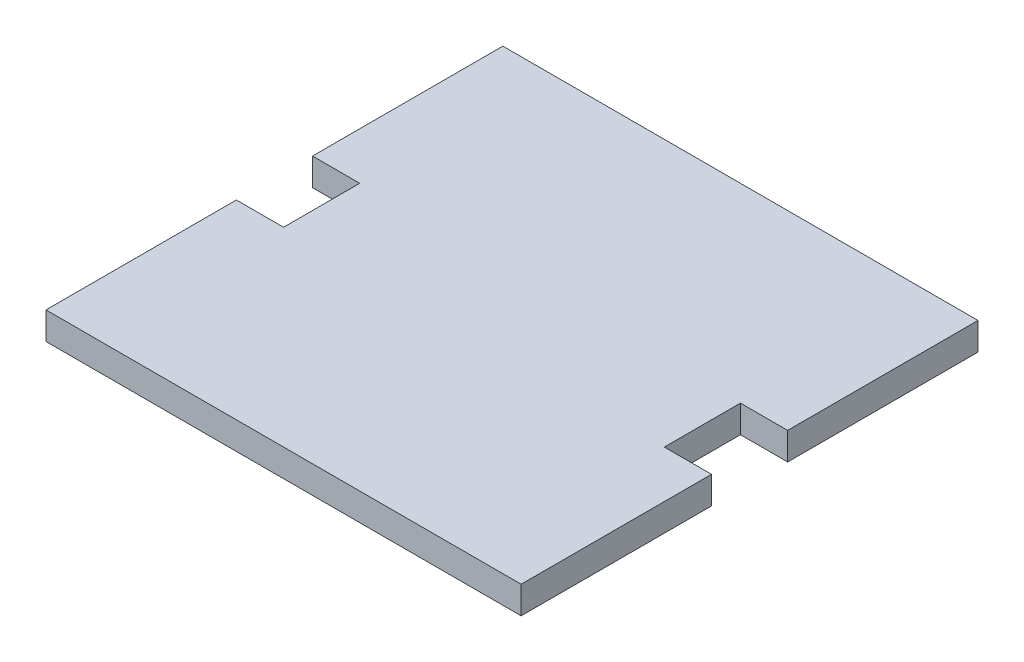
ISO-10303-21;
HEADER;
FILE_DESCRIPTION(('STEP AP214'),'2;1');
FILE_NAME('part.step','',(''),(''),'','','');
FILE_SCHEMA(('AUTOMOTIVE_DESIGN { 1 0 10303 214 1 1 1 1 }'));
ENDSEC;
DATA;
#1=APPLICATION_CONTEXT('core data for automotive mechanical design processes');
#2=APPLICATION_PROTOCOL_DEFINITION('international standard','automotive_design',2000,#1);
#3=PRODUCT_CONTEXT('',#1,'mechanical');
#4=PRODUCT('Part','Part','',(#3));
#5=PRODUCT_RELATED_PRODUCT_CATEGORY('part','',(#4));
#6=PRODUCT_DEFINITION_FORMATION('','',#4);
#7=PRODUCT_DEFINITION_CONTEXT('part definition',#1,'design');
#8=PRODUCT_DEFINITION('design','',#6,#7);
#9=PRODUCT_DEFINITION_SHAPE('','',#8);
#10=(LENGTH_UNIT() NAMED_UNIT(*) SI_UNIT(.MILLI.,.METRE.));
#11=(NAMED_UNIT(*) PLANE_ANGLE_UNIT() SI_UNIT($,.RADIAN.));
#12=(NAMED_UNIT(*) SI_UNIT($,.STERADIAN.) SOLID_ANGLE_UNIT());
#13=UNCERTAINTY_MEASURE_WITH_UNIT(LENGTH_MEASURE(1.E-05),#10,'distance_accuracy_value','');
#14=(GEOMETRIC_REPRESENTATION_CONTEXT(3) GLOBAL_UNCERTAINTY_ASSIGNED_CONTEXT((#13)) GLOBAL_UNIT_ASSIGNED_CONTEXT((#10,
#11,#12)) REPRESENTATION_CONTEXT('',''));
#15=CARTESIAN_POINT('',(0.,0.,0.));
#16=DIRECTION('',(0.,0.,1.));
#17=DIRECTION('',(1.,0.,0.));
#18=AXIS2_PLACEMENT_3D('',#15,#16,#17);
#19=CARTESIAN_POINT('',(-156.,18.,-150.));
#20=DIRECTION('',(1.,0.,0.));
#21=DIRECTION('',(0.,0.,-1.));
#22=AXIS2_PLACEMENT_3D('',#19,#20,#21);
#23=PLANE('',#22);
#24=DIRECTION('',(0.,0.,1.));
#25=VECTOR('',#24,1.);
#26=CARTESIAN_POINT('',(-156.,0.,-150.));
#27=LINE('',#26,#25);
#28=CARTESIAN_POINT('',(-156.,0.,-150.));
#29=VERTEX_POINT('',#28);
#30=CARTESIAN_POINT('',(-156.,0.,-25.));
#31=VERTEX_POINT('',#30);
#32=EDGE_CURVE('E118',#29,#31,#27,.T.);
#33=ORIENTED_EDGE('',*,*,#32,.T.);
#34=DIRECTION('',(0.,-1.,0.));
#35=VECTOR('',#34,1.);
#36=CARTESIAN_POINT('',(-156.,18.,-25.));
#37=LINE('',#36,#35);
#38=CARTESIAN_POINT('',(-156.,18.,-25.));
#39=VERTEX_POINT('',#38);
#40=EDGE_CURVE('E11',#39,#31,#37,.T.);
#41=ORIENTED_EDGE('',*,*,#40,.F.);
#42=DIRECTION('',(0.,0.,1.));
#43=VECTOR('',#42,1.);
#44=CARTESIAN_POINT('',(-156.,18.,-150.));
#45=LINE('',#44,#43);
#46=CARTESIAN_POINT('',(-156.,18.,-150.));
#47=VERTEX_POINT('',#46);
#48=EDGE_CURVE('E153',#47,#39,#45,.T.);
#49=ORIENTED_EDGE('',*,*,#48,.F.);
#50=DIRECTION('',(0.,-1.,0.));
#51=VECTOR('',#50,1.);
#52=CARTESIAN_POINT('',(-156.,18.,-150.));
#53=LINE('',#52,#51);
#54=EDGE_CURVE('E131',#47,#29,#53,.T.);
#55=ORIENTED_EDGE('',*,*,#54,.T.);
#56=EDGE_LOOP('',(#33,#41,#49,#55));
#57=FACE_BOUND('',#56,.T.);
#58=ADVANCED_FACE('F26',(#57),#23,.F.);
#59=CARTESIAN_POINT('',(-156.,18.,-25.));
#60=DIRECTION('',(0.,0.,-1.));
#61=DIRECTION('',(-1.,0.,0.));
#62=AXIS2_PLACEMENT_3D('',#59,#60,#61);
#63=PLANE('',#62);
#64=DIRECTION('',(1.,0.,0.));
#65=VECTOR('',#64,1.);
#66=CARTESIAN_POINT('',(-156.,0.,-25.));
#67=LINE('',#66,#65);
#68=CARTESIAN_POINT('',(-125.,0.,-25.));
#69=VERTEX_POINT('',#68);
#70=EDGE_CURVE('E114',#31,#69,#67,.T.);
#71=ORIENTED_EDGE('',*,*,#70,.T.);
#72=DIRECTION('',(0.,-1.,0.));
#73=VECTOR('',#72,1.);
#74=CARTESIAN_POINT('',(-125.,18.,-25.));
#75=LINE('',#74,#73);
#76=CARTESIAN_POINT('',(-125.,18.,-25.));
#77=VERTEX_POINT('',#76);
#78=EDGE_CURVE('E33',#77,#69,#75,.T.);
#79=ORIENTED_EDGE('',*,*,#78,.F.);
#80=DIRECTION('',(1.,0.,0.));
#81=VECTOR('',#80,1.);
#82=CARTESIAN_POINT('',(-156.,18.,-25.));
#83=LINE('',#82,#81);
#84=EDGE_CURVE('E127',#39,#77,#83,.T.);
#85=ORIENTED_EDGE('',*,*,#84,.F.);
#86=ORIENTED_EDGE('',*,*,#40,.T.);
#87=EDGE_LOOP('',(#71,#79,#85,#86));
#88=FACE_BOUND('',#87,.T.);
#89=ADVANCED_FACE('F126',(#88),#63,.F.);
#90=CARTESIAN_POINT('',(-125.,18.,25.));
#91=DIRECTION('',(1.,0.,0.));
#92=DIRECTION('',(0.,0.,-1.));
#93=AXIS2_PLACEMENT_3D('',#90,#91,#92);
#94=PLANE('',#93);
#95=DIRECTION('',(0.,0.,1.));
#96=VECTOR('',#95,1.);
#97=CARTESIAN_POINT('',(-125.,0.,25.));
#98=LINE('',#97,#96);
#99=CARTESIAN_POINT('',(-125.,0.,25.));
#100=VERTEX_POINT('',#99);
#101=EDGE_CURVE('E120',#69,#100,#98,.T.);
#102=ORIENTED_EDGE('',*,*,#101,.T.);
#103=DIRECTION('',(0.,-1.,0.));
#104=VECTOR('',#103,1.);
#105=CARTESIAN_POINT('',(-125.,18.,25.));
#106=LINE('',#105,#104);
#107=CARTESIAN_POINT('',(-125.,18.,25.));
#108=VERTEX_POINT('',#107);
#109=EDGE_CURVE('E199',#108,#100,#106,.T.);
#110=ORIENTED_EDGE('',*,*,#109,.F.);
#111=DIRECTION('',(0.,0.,1.));
#112=VECTOR('',#111,1.);
#113=CARTESIAN_POINT('',(-125.,18.,25.));
#114=LINE('',#113,#112);
#115=EDGE_CURVE('E156',#77,#108,#114,.T.);
#116=ORIENTED_EDGE('',*,*,#115,.F.);
#117=ORIENTED_EDGE('',*,*,#78,.T.);
#118=EDGE_LOOP('',(#102,#110,#116,#117));
#119=FACE_BOUND('',#118,.T.);
#120=ADVANCED_FACE('F203',(#119),#94,.F.);
#121=CARTESIAN_POINT('',(-156.,18.,25.));
#122=DIRECTION('',(0.,0.,1.));
#123=DIRECTION('',(1.,0.,0.));
#124=AXIS2_PLACEMENT_3D('',#121,#122,#123);
#125=PLANE('',#124);
#126=DIRECTION('',(-1.,0.,0.));
#127=VECTOR('',#126,1.);
#128=CARTESIAN_POINT('',(-156.,0.,25.));
#129=LINE('',#128,#127);
#130=CARTESIAN_POINT('',(-156.,0.,25.));
#131=VERTEX_POINT('',#130);
#132=EDGE_CURVE('E135',#100,#131,#129,.T.);
#133=ORIENTED_EDGE('',*,*,#132,.T.);
#134=DIRECTION('',(0.,-1.,0.));
#135=VECTOR('',#134,1.);
#136=CARTESIAN_POINT('',(-156.,18.,25.));
#137=LINE('',#136,#135);
#138=CARTESIAN_POINT('',(-156.,18.,25.));
#139=VERTEX_POINT('',#138);
#140=EDGE_CURVE('E196',#139,#131,#137,.T.);
#141=ORIENTED_EDGE('',*,*,#140,.F.);
#142=DIRECTION('',(-1.,0.,0.));
#143=VECTOR('',#142,1.);
#144=CARTESIAN_POINT('',(-156.,18.,25.));
#145=LINE('',#144,#143);
#146=EDGE_CURVE('E158',#108,#139,#145,.T.);
#147=ORIENTED_EDGE('',*,*,#146,.F.);
#148=ORIENTED_EDGE('',*,*,#109,.T.);
#149=EDGE_LOOP('',(#133,#141,#147,#148));
#150=FACE_BOUND('',#149,.T.);
#151=ADVANCED_FACE('F211',(#150),#125,.F.);
#152=CARTESIAN_POINT('',(-156.,18.,25.));
#153=DIRECTION('',(1.,0.,0.));
#154=DIRECTION('',(0.,0.,-1.));
#155=AXIS2_PLACEMENT_3D('',#152,#153,#154);
#156=PLANE('',#155);
#157=DIRECTION('',(0.,0.,1.));
#158=VECTOR('',#157,1.);
#159=CARTESIAN_POINT('',(-156.,0.,25.));
#160=LINE('',#159,#158);
#161=CARTESIAN_POINT('',(-156.,0.,150.));
#162=VERTEX_POINT('',#161);
#163=EDGE_CURVE('E137',#131,#162,#160,.T.);
#164=ORIENTED_EDGE('',*,*,#163,.T.);
#165=DIRECTION('',(0.,-1.,0.));
#166=VECTOR('',#165,1.);
#167=CARTESIAN_POINT('',(-156.,18.,150.));
#168=LINE('',#167,#166);
#169=CARTESIAN_POINT('',(-156.,18.,150.));
#170=VERTEX_POINT('',#169);
#171=EDGE_CURVE('E193',#170,#162,#168,.T.);
#172=ORIENTED_EDGE('',*,*,#171,.F.);
#173=DIRECTION('',(0.,0.,1.));
#174=VECTOR('',#173,1.);
#175=CARTESIAN_POINT('',(-156.,18.,25.));
#176=LINE('',#175,#174);
#177=EDGE_CURVE('E160',#139,#170,#176,.T.);
#178=ORIENTED_EDGE('',*,*,#177,.F.);
#179=ORIENTED_EDGE('',*,*,#140,.T.);
#180=EDGE_LOOP('',(#164,#172,#178,#179));
#181=FACE_BOUND('',#180,.T.);
#182=ADVANCED_FACE('F214',(#181),#156,.F.);
#183=CARTESIAN_POINT('',(-156.,18.,150.));
#184=DIRECTION('',(0.,0.,-1.));
#185=DIRECTION('',(-1.,0.,0.));
#186=AXIS2_PLACEMENT_3D('',#183,#184,#185);
#187=PLANE('',#186);
#188=DIRECTION('',(1.,0.,0.));
#189=VECTOR('',#188,1.);
#190=CARTESIAN_POINT('',(-156.,0.,150.));
#191=LINE('',#190,#189);
#192=CARTESIAN_POINT('',(156.,0.,150.));
#193=VERTEX_POINT('',#192);
#194=EDGE_CURVE('E139',#162,#193,#191,.T.);
#195=ORIENTED_EDGE('',*,*,#194,.T.);
#196=DIRECTION('',(0.,-1.,0.));
#197=VECTOR('',#196,1.);
#198=CARTESIAN_POINT('',(156.,18.,150.));
#199=LINE('',#198,#197);
#200=CARTESIAN_POINT('',(156.,18.,150.));
#201=VERTEX_POINT('',#200);
#202=EDGE_CURVE('E190',#201,#193,#199,.T.);
#203=ORIENTED_EDGE('',*,*,#202,.F.);
#204=DIRECTION('',(1.,0.,0.));
#205=VECTOR('',#204,1.);
#206=CARTESIAN_POINT('',(-156.,18.,150.));
#207=LINE('',#206,#205);
#208=EDGE_CURVE('E162',#170,#201,#207,.T.);
#209=ORIENTED_EDGE('',*,*,#208,.F.);
#210=ORIENTED_EDGE('',*,*,#171,.T.);
#211=EDGE_LOOP('',(#195,#203,#209,#210));
#212=FACE_BOUND('',#211,.T.);
#213=ADVANCED_FACE('F219',(#212),#187,.F.);
#214=CARTESIAN_POINT('',(156.,18.,25.));
#215=DIRECTION('',(-1.,0.,0.));
#216=DIRECTION('',(0.,0.,1.));
#217=AXIS2_PLACEMENT_3D('',#214,#215,#216);
#218=PLANE('',#217);
#219=DIRECTION('',(0.,0.,-1.));
#220=VECTOR('',#219,1.);
#221=CARTESIAN_POINT('',(156.,0.,25.));
#222=LINE('',#221,#220);
#223=CARTESIAN_POINT('',(156.,0.,25.));
#224=VERTEX_POINT('',#223);
#225=EDGE_CURVE('E141',#193,#224,#222,.T.);
#226=ORIENTED_EDGE('',*,*,#225,.T.);
#227=DIRECTION('',(0.,-1.,0.));
#228=VECTOR('',#227,1.);
#229=CARTESIAN_POINT('',(156.,18.,25.));
#230=LINE('',#229,#228);
#231=CARTESIAN_POINT('',(156.,18.,25.));
#232=VERTEX_POINT('',#231);
#233=EDGE_CURVE('E187',#232,#224,#230,.T.);
#234=ORIENTED_EDGE('',*,*,#233,.F.);
#235=DIRECTION('',(0.,0.,-1.));
#236=VECTOR('',#235,1.);
#237=CARTESIAN_POINT('',(156.,18.,25.));
#238=LINE('',#237,#236);
#239=EDGE_CURVE('E164',#201,#232,#238,.T.);
#240=ORIENTED_EDGE('',*,*,#239,.F.);
#241=ORIENTED_EDGE('',*,*,#202,.T.);
#242=EDGE_LOOP('',(#226,#234,#240,#241));
#243=FACE_BOUND('',#242,.T.);
#244=ADVANCED_FACE('F225',(#243),#218,.F.);
#245=CARTESIAN_POINT('',(156.,18.,25.));
#246=DIRECTION('',(0.,0.,1.));
#247=DIRECTION('',(1.,0.,0.));
#248=AXIS2_PLACEMENT_3D('',#245,#246,#247);
#249=PLANE('',#248);
#250=DIRECTION('',(-1.,0.,0.));
#251=VECTOR('',#250,1.);
#252=CARTESIAN_POINT('',(156.,0.,25.));
#253=LINE('',#252,#251);
#254=CARTESIAN_POINT('',(125.,0.,25.));
#255=VERTEX_POINT('',#254);
#256=EDGE_CURVE('E143',#224,#255,#253,.T.);
#257=ORIENTED_EDGE('',*,*,#256,.T.);
#258=DIRECTION('',(0.,-1.,0.));
#259=VECTOR('',#258,1.);
#260=CARTESIAN_POINT('',(125.,18.,25.));
#261=LINE('',#260,#259);
#262=CARTESIAN_POINT('',(125.,18.,25.));
#263=VERTEX_POINT('',#262);
#264=EDGE_CURVE('E184',#263,#255,#261,.T.);
#265=ORIENTED_EDGE('',*,*,#264,.F.);
#266=DIRECTION('',(-1.,0.,0.));
#267=VECTOR('',#266,1.);
#268=CARTESIAN_POINT('',(156.,18.,25.));
#269=LINE('',#268,#267);
#270=EDGE_CURVE('E166',#232,#263,#269,.T.);
#271=ORIENTED_EDGE('',*,*,#270,.F.);
#272=ORIENTED_EDGE('',*,*,#233,.T.);
#273=EDGE_LOOP('',(#257,#265,#271,#272));
#274=FACE_BOUND('',#273,.T.);
#275=ADVANCED_FACE('F229',(#274),#249,.F.);
#276=CARTESIAN_POINT('',(125.,18.,25.));
#277=DIRECTION('',(-1.,0.,0.));
#278=DIRECTION('',(0.,0.,1.));
#279=AXIS2_PLACEMENT_3D('',#276,#277,#278);
#280=PLANE('',#279);
#281=DIRECTION('',(0.,0.,-1.));
#282=VECTOR('',#281,1.);
#283=CARTESIAN_POINT('',(125.,0.,25.));
#284=LINE('',#283,#282);
#285=CARTESIAN_POINT('',(125.,0.,-25.));
#286=VERTEX_POINT('',#285);
#287=EDGE_CURVE('E145',#255,#286,#284,.T.);
#288=ORIENTED_EDGE('',*,*,#287,.T.);
#289=DIRECTION('',(0.,-1.,0.));
#290=VECTOR('',#289,1.);
#291=CARTESIAN_POINT('',(125.,18.,-25.));
#292=LINE('',#291,#290);
#293=CARTESIAN_POINT('',(125.,18.,-25.));
#294=VERTEX_POINT('',#293);
#295=EDGE_CURVE('E181',#294,#286,#292,.T.);
#296=ORIENTED_EDGE('',*,*,#295,.F.);
#297=DIRECTION('',(0.,0.,-1.));
#298=VECTOR('',#297,1.);
#299=CARTESIAN_POINT('',(125.,18.,25.));
#300=LINE('',#299,#298);
#301=EDGE_CURVE('E168',#263,#294,#300,.T.);
#302=ORIENTED_EDGE('',*,*,#301,.F.);
#303=ORIENTED_EDGE('',*,*,#264,.T.);
#304=EDGE_LOOP('',(#288,#296,#302,#303));
#305=FACE_BOUND('',#304,.T.);
#306=ADVANCED_FACE('F234',(#305),#280,.F.);
#307=CARTESIAN_POINT('',(156.,18.,-25.));
#308=DIRECTION('',(0.,0.,-1.));
#309=DIRECTION('',(-1.,0.,0.));
#310=AXIS2_PLACEMENT_3D('',#307,#308,#309);
#311=PLANE('',#310);
#312=DIRECTION('',(1.,0.,0.));
#313=VECTOR('',#312,1.);
#314=CARTESIAN_POINT('',(156.,0.,-25.));
#315=LINE('',#314,#313);
#316=CARTESIAN_POINT('',(156.,0.,-25.));
#317=VERTEX_POINT('',#316);
#318=EDGE_CURVE('E147',#286,#317,#315,.T.);
#319=ORIENTED_EDGE('',*,*,#318,.T.);
#320=DIRECTION('',(0.,-1.,0.));
#321=VECTOR('',#320,1.);
#322=CARTESIAN_POINT('',(156.,18.,-25.));
#323=LINE('',#322,#321);
#324=CARTESIAN_POINT('',(156.,18.,-25.));
#325=VERTEX_POINT('',#324);
#326=EDGE_CURVE('E178',#325,#317,#323,.T.);
#327=ORIENTED_EDGE('',*,*,#326,.F.);
#328=DIRECTION('',(1.,0.,0.));
#329=VECTOR('',#328,1.);
#330=CARTESIAN_POINT('',(156.,18.,-25.));
#331=LINE('',#330,#329);
#332=EDGE_CURVE('E170',#294,#325,#331,.T.);
#333=ORIENTED_EDGE('',*,*,#332,.F.);
#334=ORIENTED_EDGE('',*,*,#295,.T.);
#335=EDGE_LOOP('',(#319,#327,#333,#334));
#336=FACE_BOUND('',#335,.T.);
#337=ADVANCED_FACE('F238',(#336),#311,.F.);
#338=CARTESIAN_POINT('',(156.,18.,-150.));
#339=DIRECTION('',(-1.,0.,0.));
#340=DIRECTION('',(0.,0.,1.));
#341=AXIS2_PLACEMENT_3D('',#338,#339,#340);
#342=PLANE('',#341);
#343=DIRECTION('',(0.,0.,-1.));
#344=VECTOR('',#343,1.);
#345=CARTESIAN_POINT('',(156.,0.,-150.));
#346=LINE('',#345,#344);
#347=CARTESIAN_POINT('',(156.,0.,-150.));
#348=VERTEX_POINT('',#347);
#349=EDGE_CURVE('E149',#317,#348,#346,.T.);
#350=ORIENTED_EDGE('',*,*,#349,.T.);
#351=DIRECTION('',(0.,-1.,0.));
#352=VECTOR('',#351,1.);
#353=CARTESIAN_POINT('',(156.,18.,-150.));
#354=LINE('',#353,#352);
#355=CARTESIAN_POINT('',(156.,18.,-150.));
#356=VERTEX_POINT('',#355);
#357=EDGE_CURVE('E175',#356,#348,#354,.T.);
#358=ORIENTED_EDGE('',*,*,#357,.F.);
#359=DIRECTION('',(0.,0.,-1.));
#360=VECTOR('',#359,1.);
#361=CARTESIAN_POINT('',(156.,18.,-150.));
#362=LINE('',#361,#360);
#363=EDGE_CURVE('E45',#325,#356,#362,.T.);
#364=ORIENTED_EDGE('',*,*,#363,.F.);
#365=ORIENTED_EDGE('',*,*,#326,.T.);
#366=EDGE_LOOP('',(#350,#358,#364,#365));
#367=FACE_BOUND('',#366,.T.);
#368=ADVANCED_FACE('F242',(#367),#342,.F.);
#369=CARTESIAN_POINT('',(-156.,18.,-150.));
#370=DIRECTION('',(0.,0.,1.));
#371=DIRECTION('',(1.,0.,0.));
#372=AXIS2_PLACEMENT_3D('',#369,#370,#371);
#373=PLANE('',#372);
#374=DIRECTION('',(-1.,0.,0.));
#375=VECTOR('',#374,1.);
#376=CARTESIAN_POINT('',(-156.,0.,-150.));
#377=LINE('',#376,#375);
#378=EDGE_CURVE('E151',#348,#29,#377,.T.);
#379=ORIENTED_EDGE('',*,*,#378,.T.);
#380=ORIENTED_EDGE('',*,*,#54,.F.);
#381=DIRECTION('',(-1.,0.,0.));
#382=VECTOR('',#381,1.);
#383=CARTESIAN_POINT('',(-156.,18.,-150.));
#384=LINE('',#383,#382);
#385=EDGE_CURVE('E40',#356,#47,#384,.T.);
#386=ORIENTED_EDGE('',*,*,#385,.F.);
#387=ORIENTED_EDGE('',*,*,#357,.T.);
#388=EDGE_LOOP('',(#379,#380,#386,#387));
#389=FACE_BOUND('',#388,.T.);
#390=ADVANCED_FACE('F244',(#389),#373,.F.);
#391=CARTESIAN_POINT('',(-156.,18.,150.));
#392=DIRECTION('',(0.,1.,0.));
#393=DIRECTION('',(0.,0.,1.));
#394=AXIS2_PLACEMENT_3D('',#391,#392,#393);
#395=PLANE('',#394);
#396=ORIENTED_EDGE('',*,*,#48,.T.);
#397=ORIENTED_EDGE('',*,*,#84,.T.);
#398=ORIENTED_EDGE('',*,*,#115,.T.);
#399=ORIENTED_EDGE('',*,*,#146,.T.);
#400=ORIENTED_EDGE('',*,*,#177,.T.);
#401=ORIENTED_EDGE('',*,*,#208,.T.);
#402=ORIENTED_EDGE('',*,*,#239,.T.);
#403=ORIENTED_EDGE('',*,*,#270,.T.);
#404=ORIENTED_EDGE('',*,*,#301,.T.);
#405=ORIENTED_EDGE('',*,*,#332,.T.);
#406=ORIENTED_EDGE('',*,*,#363,.T.);
#407=ORIENTED_EDGE('',*,*,#385,.T.);
#408=EDGE_LOOP('',(#396,#397,#398,#399,#400,#401,#402,#403,#404,#405,#406,#407));
#409=FACE_BOUND('',#408,.T.);
#410=ADVANCED_FACE('F206',(#409),#395,.T.);
#411=CARTESIAN_POINT('',(-156.,0.,150.));
#412=DIRECTION('',(0.,1.,0.));
#413=DIRECTION('',(0.,0.,1.));
#414=AXIS2_PLACEMENT_3D('',#411,#412,#413);
#415=PLANE('',#414);
#416=ORIENTED_EDGE('',*,*,#32,.F.);
#417=ORIENTED_EDGE('',*,*,#378,.F.);
#418=ORIENTED_EDGE('',*,*,#349,.F.);
#419=ORIENTED_EDGE('',*,*,#318,.F.);
#420=ORIENTED_EDGE('',*,*,#287,.F.);
#421=ORIENTED_EDGE('',*,*,#256,.F.);
#422=ORIENTED_EDGE('',*,*,#225,.F.);
#423=ORIENTED_EDGE('',*,*,#194,.F.);
#424=ORIENTED_EDGE('',*,*,#163,.F.);
#425=ORIENTED_EDGE('',*,*,#132,.F.);
#426=ORIENTED_EDGE('',*,*,#101,.F.);
#427=ORIENTED_EDGE('',*,*,#70,.F.);
#428=EDGE_LOOP('',(#416,#417,#418,#419,#420,#421,#422,#423,#424,#425,#426,#427));
#429=FACE_BOUND('',#428,.T.);
#430=ADVANCED_FACE('F115',(#429),#415,.F.);
#431=CLOSED_SHELL('',(#58,#89,#120,#151,#182,#213,#244,#275,#306,#337,#368,#390,#410,#430));
#432=MANIFOLD_SOLID_BREP('B2',#431);
#433=ADVANCED_BREP_SHAPE_REPRESENTATION('',(#18,#432),#14);
#434=SHAPE_DEFINITION_REPRESENTATION(#9,#433);
ENDSEC;
END-ISO-10303-21;
